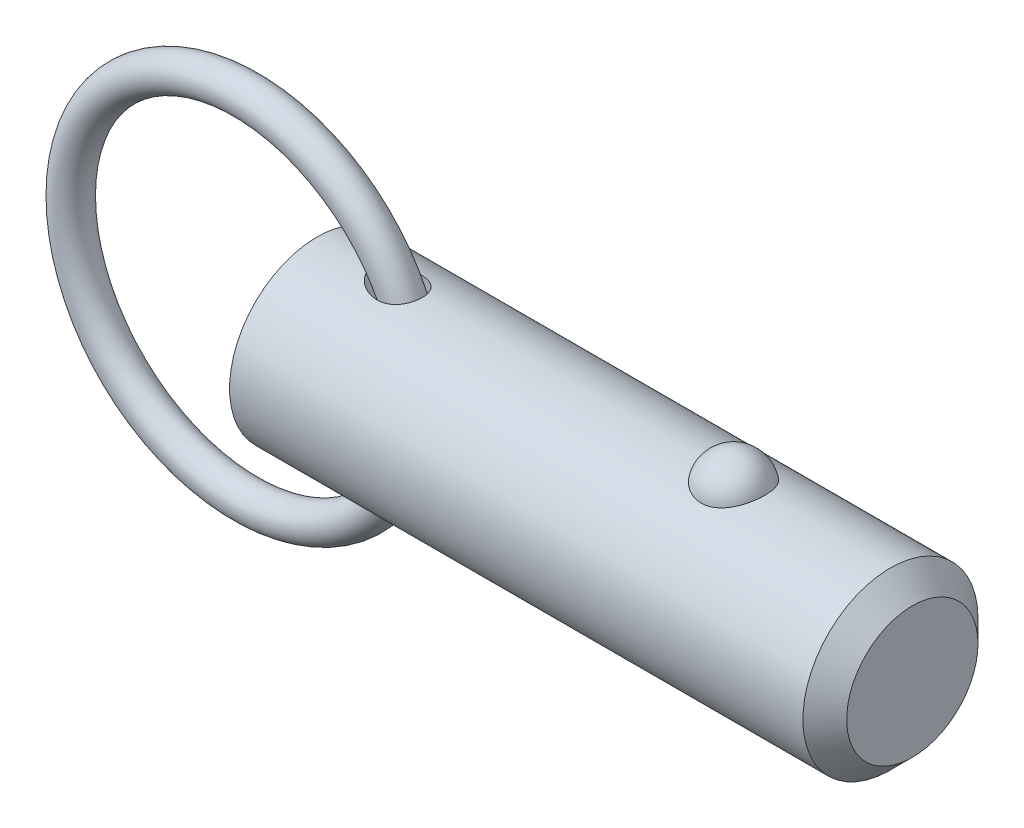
ISO-10303-21;
HEADER;
FILE_DESCRIPTION(('STEP AP214'),'2;1');
FILE_NAME('part.step','',(''),(''),'','','');
FILE_SCHEMA(('AUTOMOTIVE_DESIGN { 1 0 10303 214 1 1 1 1 }'));
ENDSEC;
DATA;
#1=APPLICATION_CONTEXT('core data for automotive mechanical design processes');
#2=APPLICATION_PROTOCOL_DEFINITION('international standard','automotive_design',2000,#1);
#3=PRODUCT_CONTEXT('',#1,'mechanical');
#4=PRODUCT('Part','Part','',(#3));
#5=PRODUCT_RELATED_PRODUCT_CATEGORY('part','',(#4));
#6=PRODUCT_DEFINITION_FORMATION('','',#4);
#7=PRODUCT_DEFINITION_CONTEXT('part definition',#1,'design');
#8=PRODUCT_DEFINITION('design','',#6,#7);
#9=PRODUCT_DEFINITION_SHAPE('','',#8);
#10=(LENGTH_UNIT() NAMED_UNIT(*) SI_UNIT(.MILLI.,.METRE.));
#11=(NAMED_UNIT(*) PLANE_ANGLE_UNIT() SI_UNIT($,.RADIAN.));
#12=(NAMED_UNIT(*) SI_UNIT($,.STERADIAN.) SOLID_ANGLE_UNIT());
#13=UNCERTAINTY_MEASURE_WITH_UNIT(LENGTH_MEASURE(1.E-05),#10,'distance_accuracy_value','');
#14=(GEOMETRIC_REPRESENTATION_CONTEXT(3) GLOBAL_UNCERTAINTY_ASSIGNED_CONTEXT((#13)) GLOBAL_UNIT_ASSIGNED_CONTEXT((#10,
#11,#12)) REPRESENTATION_CONTEXT('',''));
#15=CARTESIAN_POINT('',(0.,0.,0.));
#16=DIRECTION('',(0.,0.,1.));
#17=DIRECTION('',(1.,0.,0.));
#18=AXIS2_PLACEMENT_3D('',#15,#16,#17);
#19=CARTESIAN_POINT('',(-6.46799987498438,0.,0.));
#20=DIRECTION('',(0.,0.,1.));
#21=DIRECTION('',(1.,0.,0.));
#22=AXIS2_PLACEMENT_3D('',#19,#20,#21);
#23=TOROIDAL_SURFACE('',#22,15.875,1.588);
#24=CARTESIAN_POINT('',(10.9950001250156,0.,0.));
#25=VERTEX_POINT('',#24);
#26=VERTEX_LOOP('',#25);
#27=FACE_BOUND('',#26,.T.);
#28=ADVANCED_FACE('P0_F12',(#27),#23,.T.);
#29=CLOSED_SHELL('',(#28));
#30=MANIFOLD_SOLID_BREP('P0_B1',#29);
#31=CARTESIAN_POINT('',(0.,0.,0.));
#32=DIRECTION('',(1.,0.,0.));
#33=DIRECTION('',(0.,0.,-1.));
#34=AXIS2_PLACEMENT_3D('',#31,#32,#33);
#35=CYLINDRICAL_SURFACE('',#34,7.94);
#36=CARTESIAN_POINT('',(5.37881269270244,7.8641200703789,-1.0950869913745));
#37=CARTESIAN_POINT('',(5.49078530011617,7.84653010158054,-1.22142628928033));
#38=CARTESIAN_POINT('',(5.61742164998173,7.82766483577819,-1.33478448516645));
#39=CARTESIAN_POINT('',(5.82155225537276,7.80005811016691,-1.48501770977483));
#40=CARTESIAN_POINT('',(5.89211597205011,7.79095331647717,-1.53186949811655));
#41=CARTESIAN_POINT('',(6.03726296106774,7.77331484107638,-1.61899652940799));
#42=CARTESIAN_POINT('',(6.11184478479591,7.76478095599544,-1.65927412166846));
#43=CARTESIAN_POINT('',(6.3183154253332,7.74290334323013,-1.75933205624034));
#44=CARTESIAN_POINT('',(6.45343253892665,7.73042593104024,-1.81276183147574));
#45=CARTESIAN_POINT('',(6.73017339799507,7.70966096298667,-1.89912673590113));
#46=CARTESIAN_POINT('',(6.87179099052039,7.70136953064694,-1.93208083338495));
#47=CARTESIAN_POINT('',(7.17522096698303,7.6896684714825,-1.97820987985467));
#48=CARTESIAN_POINT('',(7.33750100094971,7.68691980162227,-1.98871513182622));
#49=CARTESIAN_POINT('',(7.5799424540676,7.68880305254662,-1.98137951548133));
#50=CARTESIAN_POINT('',(7.66059155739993,7.69043175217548,-1.97508575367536));
#51=CARTESIAN_POINT('',(7.82077465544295,7.69570110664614,-1.95445819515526));
#52=CARTESIAN_POINT('',(7.90030910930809,7.69934090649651,-1.94012781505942));
#53=CARTESIAN_POINT('',(8.092800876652,7.71066069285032,-1.89475688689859));
#54=CARTESIAN_POINT('',(8.2046520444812,7.71942251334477,-1.85909462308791));
#55=CARTESIAN_POINT('',(8.42059371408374,7.74035594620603,-1.7699066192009));
#56=CARTESIAN_POINT('',(8.52468939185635,7.75252525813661,-1.7163929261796));
#57=CARTESIAN_POINT('',(8.72211003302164,7.77903750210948,-1.59192358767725));
#58=CARTESIAN_POINT('',(8.81539818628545,7.79338749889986,-1.52091076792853));
#59=CARTESIAN_POINT('',(8.98759177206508,7.8225086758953,-1.36321590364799));
#60=CARTESIAN_POINT('',(9.06649712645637,7.83727985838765,-1.27653377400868));
#61=CARTESIAN_POINT('',(9.20311499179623,7.86453692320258,-1.09567667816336));
#62=CARTESIAN_POINT('',(9.26180839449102,7.8771064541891,-1.00225329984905));
#63=CARTESIAN_POINT('',(9.36257622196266,7.89954213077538,-0.806547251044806));
#64=CARTESIAN_POINT('',(9.40465301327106,7.9094086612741,-0.704265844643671));
#65=CARTESIAN_POINT('',(9.47062404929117,7.92520709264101,-0.495461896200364));
#66=CARTESIAN_POINT('',(9.49478817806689,7.9311972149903,-0.38902885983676));
#67=CARTESIAN_POINT('',(9.52544004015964,7.93883641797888,-0.17349446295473));
#68=CARTESIAN_POINT('',(9.53192786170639,7.94048552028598,-0.0643931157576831));
#69=CARTESIAN_POINT('',(9.52707996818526,7.93926454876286,0.153487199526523));
#70=CARTESIAN_POINT('',(9.51572796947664,7.93639034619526,0.262265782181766));
#71=CARTESIAN_POINT('',(9.47542322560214,7.92642470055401,0.47631311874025));
#72=CARTESIAN_POINT('',(9.44647056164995,7.91933327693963,0.581581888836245));
#73=CARTESIAN_POINT('',(9.37164011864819,7.90170355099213,0.785602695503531));
#74=CARTESIAN_POINT('',(9.32576415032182,7.89116561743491,0.884355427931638));
#75=CARTESIAN_POINT('',(9.21823065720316,7.8677977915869,1.07254831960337));
#76=CARTESIAN_POINT('',(9.15657431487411,7.85496807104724,1.16198917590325));
#77=CARTESIAN_POINT('',(9.01919194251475,7.82843688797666,1.32903649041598));
#78=CARTESIAN_POINT('',(8.94347744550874,7.81473614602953,1.40665255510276));
#79=CARTESIAN_POINT('',(8.78012086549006,7.7879321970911,1.5481977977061));
#80=CARTESIAN_POINT('',(8.69247914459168,7.77482897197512,1.61212739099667));
#81=CARTESIAN_POINT('',(8.5064231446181,7.75037063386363,1.72592270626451));
#82=CARTESIAN_POINT('',(8.40786430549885,7.73904540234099,1.77555777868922));
#83=CARTESIAN_POINT('',(8.20398708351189,7.71943979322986,1.85894844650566));
#84=CARTESIAN_POINT('',(8.09866701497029,7.7111601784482,1.89270006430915));
#85=CARTESIAN_POINT('',(7.87703213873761,7.69782475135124,1.94625652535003));
#86=CARTESIAN_POINT('',(7.76044899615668,7.69301557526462,1.96500324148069));
#87=CARTESIAN_POINT('',(7.5257425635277,7.68770484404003,1.98567257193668));
#88=CARTESIAN_POINT('',(7.40761868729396,7.68720497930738,1.98758858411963));
#89=CARTESIAN_POINT('',(7.15639592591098,7.69044495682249,1.97502233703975));
#90=CARTESIAN_POINT('',(7.02341871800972,7.69476380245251,1.9583009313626));
#91=CARTESIAN_POINT('',(6.76125891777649,7.70776394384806,1.90648094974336));
#92=CARTESIAN_POINT('',(6.63208047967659,7.71644984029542,1.87136299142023));
#93=CARTESIAN_POINT('',(6.35978215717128,7.73875442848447,1.77707737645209));
#94=CARTESIAN_POINT('',(6.2177212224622,7.75293863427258,1.71496895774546));
#95=CARTESIAN_POINT('',(5.94559201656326,7.78383102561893,1.56880760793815));
#96=CARTESIAN_POINT('',(5.81552062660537,7.80053855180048,1.48476040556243));
#97=CARTESIAN_POINT('',(5.60081087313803,7.83035955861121,1.31701356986));
#98=CARTESIAN_POINT('',(5.51265224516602,7.84340226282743,1.23780647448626));
#99=CARTESIAN_POINT('',(5.34976240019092,7.86852524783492,1.06647953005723));
#100=CARTESIAN_POINT('',(5.27500719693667,7.88060722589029,0.974383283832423));
#101=CARTESIAN_POINT('',(5.15877594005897,7.89990441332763,0.800548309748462));
#102=CARTESIAN_POINT('',(5.11360209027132,7.90759876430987,0.721348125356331));
#103=CARTESIAN_POINT('',(5.03655060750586,7.92090267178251,0.556518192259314));
#104=CARTESIAN_POINT('',(5.00466157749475,7.92651401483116,0.470894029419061));
#105=CARTESIAN_POINT('',(4.95653766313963,7.93503671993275,0.294356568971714));
#106=CARTESIAN_POINT('',(4.94043621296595,7.93792505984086,0.203404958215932));
#107=CARTESIAN_POINT('',(4.92605720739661,7.94050250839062,0.0200631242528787));
#108=CARTESIAN_POINT('',(4.92776929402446,7.9401934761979,-0.0723262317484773));
#109=CARTESIAN_POINT('',(4.94742735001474,7.93667454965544,-0.243250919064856));
#110=CARTESIAN_POINT('',(4.96327131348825,7.93384031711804,-0.322048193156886));
#111=CARTESIAN_POINT('',(5.00707570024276,7.92609115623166,-0.476058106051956));
#112=CARTESIAN_POINT('',(5.03503965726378,7.92117562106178,-0.55126969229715));
#113=CARTESIAN_POINT('',(5.10737112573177,7.90866290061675,-0.709995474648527));
#114=CARTESIAN_POINT('',(5.15379379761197,7.90074105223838,-0.792541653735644));
#115=CARTESIAN_POINT('',(5.25820836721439,7.88338732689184,-0.949781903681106));
#116=CARTESIAN_POINT('',(5.31621941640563,7.87395295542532,-1.02446265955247));
#117=CARTESIAN_POINT('',(5.37881269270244,7.8641200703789,-1.0950869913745));
#118=B_SPLINE_CURVE_WITH_KNOTS('',3,(#36,#37,#38,#39,#40,#41,#42,#43,#44,#45,#46,#47,#48,#49,
#50,#51,#52,#53,#54,#55,#56,#57,#58,#59,#60,#61,#62,#63,#64,#65,#66,#67,#68,#69,#70,#71,#72,#73,
#74,#75,#76,#77,#78,#79,#80,#81,#82,#83,#84,#85,#86,#87,#88,#89,#90,#91,#92,#93,#94,#95,#96,#97,
#98,#99,#100,#101,#102,#103,#104,#105,#106,#107,#108,#109,#110,#111,#112,#113,#114,#115,#116,
#117),.UNSPECIFIED.,.T.,.F.,(4,2,2,2,2,2,2,2,2,2,2,2,2,2,2,2,2,2,2,2,2,2,2,2,2,2,2,2,2,2,2,2,2,
2,2,2,2,2,2,2,4),(0.,0.508599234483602,0.763935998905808,1.01918131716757,1.45492798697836,
1.89027038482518,2.37502798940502,2.61739702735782,2.8596631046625,3.21120678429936,
3.56251370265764,3.91498401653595,4.26745624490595,4.59897839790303,4.93045331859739,
5.25682643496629,5.58319792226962,5.909867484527,6.23653553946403,6.56316865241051,
6.88977729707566,7.21611917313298,7.54245114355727,7.87378632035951,8.20520442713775,
8.55832700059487,8.91158808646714,9.31234018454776,9.71351536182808,10.1786231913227,
10.6436096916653,11.0001264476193,11.3559986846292,11.6294791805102,11.9027245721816,
12.1782599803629,12.4536351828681,12.693828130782,12.9340911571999,13.2179277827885,
13.5022374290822),.UNSPECIFIED.);
#119=CARTESIAN_POINT('',(5.37881269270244,7.8641200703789,-1.0950869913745));
#120=VERTEX_POINT('',#119);
#121=EDGE_CURVE('P1_E40',#120,#120,#118,.T.);
#122=ORIENTED_EDGE('',*,*,#121,.T.);
#123=EDGE_LOOP('',(#122));
#124=FACE_BOUND('',#123,.T.);
#125=CARTESIAN_POINT('',(51.995,0.,0.));
#126=DIRECTION('',(1.,0.,0.));
#127=DIRECTION('',(0.,0.,-1.));
#128=AXIS2_PLACEMENT_3D('',#125,#126,#127);
#129=CIRCLE('',#128,7.94);
#130=CARTESIAN_POINT('',(51.995,0.,-7.94));
#131=VERTEX_POINT('',#130);
#132=EDGE_CURVE('P1_E25',#131,#131,#129,.T.);
#133=ORIENTED_EDGE('',*,*,#132,.F.);
#134=EDGE_LOOP('',(#133));
#135=FACE_BOUND('',#134,.T.);
#136=CARTESIAN_POINT('',(0.,0.,0.));
#137=DIRECTION('',(1.,0.,0.));
#138=DIRECTION('',(0.,0.,-1.));
#139=AXIS2_PLACEMENT_3D('',#136,#137,#138);
#140=CIRCLE('',#139,7.94);
#141=CARTESIAN_POINT('',(0.,0.,-7.94));
#142=VERTEX_POINT('',#141);
#143=EDGE_CURVE('P1_E9',#142,#142,#140,.T.);
#144=ORIENTED_EDGE('',*,*,#143,.T.);
#145=EDGE_LOOP('',(#144));
#146=FACE_BOUND('',#145,.T.);
#147=CARTESIAN_POINT('',(37.7649074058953,7.37767842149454,2.93486986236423));
#148=CARTESIAN_POINT('',(37.6127496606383,7.3776732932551,2.93487505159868));
#149=CARTESIAN_POINT('',(37.4606329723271,7.38258419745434,2.92262454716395));
#150=CARTESIAN_POINT('',(37.1609284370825,7.40163229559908,2.87404196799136));
#151=CARTESIAN_POINT('',(37.0133394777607,7.41576720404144,2.83771585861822));
#152=CARTESIAN_POINT('',(36.7270187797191,7.4516157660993,2.74218769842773));
#153=CARTESIAN_POINT('',(36.5882745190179,7.47331841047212,2.68301886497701));
#154=CARTESIAN_POINT('',(36.3228822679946,7.52194082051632,2.54350967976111));
#155=CARTESIAN_POINT('',(36.1962366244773,7.5488615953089,2.46316523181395));
#156=CARTESIAN_POINT('',(35.9545349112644,7.60594671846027,2.2809037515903));
#157=CARTESIAN_POINT('',(35.8399065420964,7.63618114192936,2.17844211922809));
#158=CARTESIAN_POINT('',(35.6288787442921,7.69614046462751,1.95608495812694));
#159=CARTESIAN_POINT('',(35.5324826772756,7.72586526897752,1.83618622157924));
#160=CARTESIAN_POINT('',(35.3559381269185,7.78314821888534,1.57628086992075));
#161=CARTESIAN_POINT('',(35.2767072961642,7.81055035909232,1.43561546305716));
#162=CARTESIAN_POINT('',(35.1417979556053,7.85879631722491,1.14236334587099));
#163=CARTESIAN_POINT('',(35.0861216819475,7.87963951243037,0.98977550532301));
#164=CARTESIAN_POINT('',(34.9988121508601,7.91289645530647,0.674619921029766));
#165=CARTESIAN_POINT('',(34.9675309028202,7.925186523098,0.511941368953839));
#166=CARTESIAN_POINT('',(34.930975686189,7.93958930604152,0.183247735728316));
#167=CARTESIAN_POINT('',(34.9257012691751,7.94170219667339,0.017232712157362));
#168=CARTESIAN_POINT('',(34.9412311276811,7.93554931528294,-0.312672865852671));
#169=CARTESIAN_POINT('',(34.9619253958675,7.92732732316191,-0.4765694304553));
#170=CARTESIAN_POINT('',(35.0287865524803,7.90141534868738,-0.798305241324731));
#171=CARTESIAN_POINT('',(35.0749539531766,7.88372517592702,-0.956144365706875));
#172=CARTESIAN_POINT('',(35.1918986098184,7.84066230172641,-1.26152073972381));
#173=CARTESIAN_POINT('',(35.2627046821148,7.81528060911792,-1.40904568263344));
#174=CARTESIAN_POINT('',(35.4274789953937,7.7594867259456,-1.68950598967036));
#175=CARTESIAN_POINT('',(35.5214488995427,7.72907417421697,-1.82244030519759));
#176=CARTESIAN_POINT('',(35.7308391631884,7.66640424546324,-2.07032792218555));
#177=CARTESIAN_POINT('',(35.8463152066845,7.63414223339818,-2.1852330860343));
#178=CARTESIAN_POINT('',(36.0959006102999,7.57149681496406,-2.39329737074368));
#179=CARTESIAN_POINT('',(36.2300080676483,7.54111321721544,-2.48645870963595));
#180=CARTESIAN_POINT('',(36.5101113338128,7.48650742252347,-2.64628132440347));
#181=CARTESIAN_POINT('',(36.6557605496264,7.46215900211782,-2.71350554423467));
#182=CARTESIAN_POINT('',(36.9574259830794,7.42171253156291,-2.82226614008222));
#183=CARTESIAN_POINT('',(37.1134383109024,7.40561140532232,-2.86381209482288));
#184=CARTESIAN_POINT('',(37.4229708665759,7.3842679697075,-2.9183907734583));
#185=CARTESIAN_POINT('',(37.5762229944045,7.37852109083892,-2.93275024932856));
#186=CARTESIAN_POINT('',(37.8830705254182,7.37700973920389,-2.93655208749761));
#187=CARTESIAN_POINT('',(38.0366658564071,7.38124333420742,-2.92599927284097));
#188=CARTESIAN_POINT('',(38.3349907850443,7.39890635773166,-2.88102897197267));
#189=CARTESIAN_POINT('',(38.4798480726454,7.41205491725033,-2.8473399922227));
#190=CARTESIAN_POINT('',(38.7616432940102,7.445801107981,-2.75788206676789));
#191=CARTESIAN_POINT('',(38.8985805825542,7.46639934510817,-2.70211132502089));
#192=CARTESIAN_POINT('',(39.1640619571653,7.51339098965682,-2.56858908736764));
#193=CARTESIAN_POINT('',(39.2923548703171,7.53990200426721,-2.49038067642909));
#194=CARTESIAN_POINT('',(39.5342440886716,7.59569503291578,-2.31462737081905));
#195=CARTESIAN_POINT('',(39.6478370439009,7.6249776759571,-2.21707808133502));
#196=CARTESIAN_POINT('',(39.86322156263,7.68489473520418,-1.99982049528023));
#197=CARTESIAN_POINT('',(39.9641488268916,7.71552419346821,-1.87925337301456));
#198=CARTESIAN_POINT('',(40.1451866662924,7.77353016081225,-1.62268826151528));
#199=CARTESIAN_POINT('',(40.2252934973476,7.80090608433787,-1.4866875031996));
#200=CARTESIAN_POINT('',(40.3653615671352,7.85047992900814,-1.19818413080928));
#201=CARTESIAN_POINT('',(40.4245877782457,7.87248183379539,-1.04529016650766));
#202=CARTESIAN_POINT('',(40.5179821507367,7.90785114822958,-0.731080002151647));
#203=CARTESIAN_POINT('',(40.5521497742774,7.92121837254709,-0.569763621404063));
#204=CARTESIAN_POINT('',(40.594795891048,7.93797834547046,-0.242812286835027));
#205=CARTESIAN_POINT('',(40.6032047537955,7.94134405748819,-0.0771668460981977));
#206=CARTESIAN_POINT('',(40.5939626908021,7.93767937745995,0.253276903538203));
#207=CARTESIAN_POINT('',(40.5763120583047,7.93064910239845,0.418075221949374));
#208=CARTESIAN_POINT('',(40.5154247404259,7.90695571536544,0.741525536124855));
#209=CARTESIAN_POINT('',(40.4722819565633,7.8903279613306,0.900197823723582));
#210=CARTESIAN_POINT('',(40.3613535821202,7.84916386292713,1.20759654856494));
#211=CARTESIAN_POINT('',(40.29356656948,7.82462706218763,1.35632241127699));
#212=CARTESIAN_POINT('',(40.1343718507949,7.7700669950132,1.64032869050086));
#213=CARTESIAN_POINT('',(40.0428616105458,7.7400200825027,1.77554712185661));
#214=CARTESIAN_POINT('',(39.8382960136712,7.67774175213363,2.02800648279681));
#215=CARTESIAN_POINT('',(39.7252410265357,7.64551037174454,2.14524772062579));
#216=CARTESIAN_POINT('',(39.4808318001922,7.58265895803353,2.35778002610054));
#217=CARTESIAN_POINT('',(39.3495833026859,7.55203092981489,2.45319004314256));
#218=CARTESIAN_POINT('',(39.071601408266,7.49579792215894,2.61999897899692));
#219=CARTESIAN_POINT('',(38.9248670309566,7.47019326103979,2.69139637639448));
#220=CARTESIAN_POINT('',(38.6129477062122,7.42622216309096,2.8105324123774));
#221=CARTESIAN_POINT('',(38.4472209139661,7.40825002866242,2.85700910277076));
#222=CARTESIAN_POINT('',(38.1092792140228,7.38398348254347,2.9191685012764));
#223=CARTESIAN_POINT('',(37.9370670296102,7.3776842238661,2.93486399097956));
#224=CARTESIAN_POINT('',(37.7649074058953,7.37767842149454,2.93486986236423));
#225=B_SPLINE_CURVE_WITH_KNOTS('',3,(#147,#148,#149,#150,#151,#152,#153,#154,#155,#156,#157,
#158,#159,#160,#161,#162,#163,#164,#165,#166,#167,#168,#169,#170,#171,#172,#173,#174,#175,#176,
#177,#178,#179,#180,#181,#182,#183,#184,#185,#186,#187,#188,#189,#190,#191,#192,#193,#194,#195,
#196,#197,#198,#199,#200,#201,#202,#203,#204,#205,#206,#207,#208,#209,#210,#211,#212,#213,#214,
#215,#216,#217,#218,#219,#220,#221,#222,#223,#224),.UNSPECIFIED.,.T.,.F.,(4,2,2,2,2,2,2,2,2,2,2,
2,2,2,2,2,2,2,2,2,2,2,2,2,2,2,2,2,2,2,2,2,2,2,2,2,2,2,4),(0.,0.45584132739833,0.911569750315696,
1.36663794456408,1.82179423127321,2.28978983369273,2.7578716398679,3.246853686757,
3.73588214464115,4.23184282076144,4.72779494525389,5.22165321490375,5.71552141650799,
6.20996917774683,6.70445245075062,7.20023431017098,7.69596557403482,8.18023418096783,
8.66432203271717,9.12410697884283,9.58380291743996,10.0296503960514,10.4755341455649,
10.9312349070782,11.3870393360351,11.8654416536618,12.3439299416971,12.8378875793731,
13.3318558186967,13.8271581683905,14.3224549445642,14.8159385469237,15.3094506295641,
15.8051323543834,16.3008055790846,16.7937101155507,17.2866458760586,17.8026240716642,
18.3183879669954),.UNSPECIFIED.);
#226=CARTESIAN_POINT('',(37.7649074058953,7.37767842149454,2.93486986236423));
#227=VERTEX_POINT('',#226);
#228=EDGE_CURVE('P1_E34',#227,#227,#225,.T.);
#229=ORIENTED_EDGE('',*,*,#228,.T.);
#230=EDGE_LOOP('',(#229));
#231=FACE_BOUND('',#230,.T.);
#232=CARTESIAN_POINT('',(5.37881269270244,-7.8641200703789,-1.0950869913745));
#233=CARTESIAN_POINT('',(5.31532711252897,-7.87409326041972,-1.02345575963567));
#234=CARTESIAN_POINT('',(5.25654962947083,-7.88365715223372,-0.947641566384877));
#235=CARTESIAN_POINT('',(5.15093536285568,-7.90122221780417,-0.787865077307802));
#236=CARTESIAN_POINT('',(5.10408931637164,-7.90922460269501,-0.703909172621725));
#237=CARTESIAN_POINT('',(5.02499142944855,-7.92292057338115,-0.5279916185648));
#238=CARTESIAN_POINT('',(4.99290048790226,-7.92858863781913,-0.435954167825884));
#239=CARTESIAN_POINT('',(4.94718343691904,-7.93670712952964,-0.247266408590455));
#240=CARTESIAN_POINT('',(4.93353142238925,-7.93916207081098,-0.150622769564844));
#241=CARTESIAN_POINT('',(4.92669426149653,-7.94038957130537,0.0306459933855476));
#242=CARTESIAN_POINT('',(4.93105622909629,-7.93960347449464,0.115182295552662));
#243=CARTESIAN_POINT('',(4.95441758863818,-7.93542535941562,0.2821331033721));
#244=CARTESIAN_POINT('',(4.97342060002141,-7.93203269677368,0.364547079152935));
#245=CARTESIAN_POINT('',(5.02337664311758,-7.92322764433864,0.521528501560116));
#246=CARTESIAN_POINT('',(5.0537758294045,-7.91790920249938,0.596281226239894));
#247=CARTESIAN_POINT('',(5.12468720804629,-7.90571364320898,0.740640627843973));
#248=CARTESIAN_POINT('',(5.16520358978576,-7.89883588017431,0.810245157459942));
#249=CARTESIAN_POINT('',(5.27792634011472,-7.88012470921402,0.97862022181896));
#250=CARTESIAN_POINT('',(5.35563200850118,-7.86757912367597,1.07363778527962));
#251=CARTESIAN_POINT('',(5.52523836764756,-7.84150676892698,1.24994147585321));
#252=CARTESIAN_POINT('',(5.61717506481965,-7.82797755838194,1.33119164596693));
#253=CARTESIAN_POINT('',(5.83913717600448,-7.79742756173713,1.50104748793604));
#254=CARTESIAN_POINT('',(5.97257429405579,-7.78050347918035,1.58521567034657));
#255=CARTESIAN_POINT('',(6.25160600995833,-7.74942135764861,1.73078109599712));
#256=CARTESIAN_POINT('',(6.39720857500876,-7.73526515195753,1.79216327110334));
#257=CARTESIAN_POINT('',(6.69793322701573,-7.7116170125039,1.89134478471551));
#258=CARTESIAN_POINT('',(6.85312134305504,-7.70216275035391,1.92895428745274));
#259=CARTESIAN_POINT('',(7.16781951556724,-7.68988337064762,1.97736316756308));
#260=CARTESIAN_POINT('',(7.32732244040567,-7.68704791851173,1.98820434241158));
#261=CARTESIAN_POINT('',(7.61290770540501,-7.68890797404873,1.98097687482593));
#262=CARTESIAN_POINT('',(7.73913797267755,-7.69217875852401,1.96837928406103));
#263=CARTESIAN_POINT('',(7.98774248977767,-7.70364253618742,1.92303262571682));
#264=CARTESIAN_POINT('',(8.11011880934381,-7.71183283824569,1.89029457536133));
#265=CARTESIAN_POINT('',(8.34766306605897,-7.73253074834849,1.80375920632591));
#266=CARTESIAN_POINT('',(8.46278682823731,-7.74506226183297,1.74984505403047));
#267=CARTESIAN_POINT('',(8.68062682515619,-7.77294147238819,1.62149891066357));
#268=CARTESIAN_POINT('',(8.78334736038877,-7.78828818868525,1.54707406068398));
#269=CARTESIAN_POINT('',(8.9627595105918,-7.81808719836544,1.38814746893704));
#270=CARTESIAN_POINT('',(9.04102925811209,-7.83247448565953,1.30540890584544));
#271=CARTESIAN_POINT('',(9.18176824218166,-7.86008608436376,1.1272733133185));
#272=CARTESIAN_POINT('',(9.24424163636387,-7.87331070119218,1.03187962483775));
#273=CARTESIAN_POINT('',(9.34924815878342,-7.89649032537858,0.83568428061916));
#274=CARTESIAN_POINT('',(9.39252490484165,-7.90656172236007,0.735293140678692));
#275=CARTESIAN_POINT('',(9.46188913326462,-7.92307290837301,0.528458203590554));
#276=CARTESIAN_POINT('',(9.48797767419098,-7.92951292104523,0.422014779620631));
#277=CARTESIAN_POINT('',(9.52228670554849,-7.93804067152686,0.206589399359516));
#278=CARTESIAN_POINT('',(9.53058328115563,-7.94014694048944,0.0976202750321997));
#279=CARTESIAN_POINT('',(9.52935292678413,-7.93983698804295,-0.120212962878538));
#280=CARTESIAN_POINT('',(9.51982577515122,-7.93742071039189,-0.229077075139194));
#281=CARTESIAN_POINT('',(9.48313466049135,-7.92831916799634,-0.443751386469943));
#282=CARTESIAN_POINT('',(9.45594838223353,-7.92162850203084,-0.549557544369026));
#283=CARTESIAN_POINT('',(9.38454658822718,-7.90469917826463,-0.754954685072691));
#284=CARTESIAN_POINT('',(9.34033171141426,-7.89446065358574,-0.854545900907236));
#285=CARTESIAN_POINT('',(9.23602927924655,-7.87157146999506,-1.04456732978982));
#286=CARTESIAN_POINT('',(9.17596171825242,-7.85892385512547,-1.13500888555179));
#287=CARTESIAN_POINT('',(9.0415343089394,-7.83259746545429,-1.30436780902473));
#288=CARTESIAN_POINT('',(8.96717562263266,-7.81891877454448,-1.38328611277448));
#289=CARTESIAN_POINT('',(8.80603455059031,-7.79196869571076,-1.52782923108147));
#290=CARTESIAN_POINT('',(8.71921490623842,-7.77869867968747,-1.59341269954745));
#291=CARTESIAN_POINT('',(8.53589430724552,-7.7539823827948,-1.7096493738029));
#292=CARTESIAN_POINT('',(8.43939269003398,-7.74253622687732,-1.76030155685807));
#293=CARTESIAN_POINT('',(8.23614706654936,-7.72219212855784,-1.84754820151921));
#294=CARTESIAN_POINT('',(8.1291686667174,-7.71339202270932,-1.88361685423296));
#295=CARTESIAN_POINT('',(7.91082287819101,-7.69955300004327,-1.93940887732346));
#296=CARTESIAN_POINT('',(7.79945379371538,-7.69451555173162,-1.95912586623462));
#297=CARTESIAN_POINT('',(7.56409927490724,-7.6881073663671,-1.98413612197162));
#298=CARTESIAN_POINT('',(7.43993744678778,-7.68713944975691,-1.98784574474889));
#299=CARTESIAN_POINT('',(7.19239878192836,-7.68969629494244,-1.97792309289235));
#300=CARTESIAN_POINT('',(7.06902225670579,-7.69322274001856,-1.96428432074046));
#301=CARTESIAN_POINT('',(6.80624991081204,-7.70498367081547,-1.91768089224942));
#302=CARTESIAN_POINT('',(6.66736121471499,-7.71386737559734,-1.88203087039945));
#303=CARTESIAN_POINT('',(6.39625444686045,-7.73551250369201,-1.79098714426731));
#304=CARTESIAN_POINT('',(6.26404857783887,-7.74828074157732,-1.73555871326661));
#305=CARTESIAN_POINT('',(6.06559048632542,-7.77003865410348,-1.63446133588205));
#306=CARTESIAN_POINT('',(5.99591479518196,-7.77821880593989,-1.59522999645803));
#307=CARTESIAN_POINT('',(5.86025875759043,-7.79503524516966,-1.51091846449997));
#308=CARTESIAN_POINT('',(5.79427944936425,-7.8036716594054,-1.46583664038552));
#309=CARTESIAN_POINT('',(5.60322733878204,-7.82978128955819,-1.3219827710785));
#310=CARTESIAN_POINT('',(5.4844964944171,-7.84751780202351,-1.21433077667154));
#311=CARTESIAN_POINT('',(5.37881269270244,-7.8641200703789,-1.0950869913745));
#312=B_SPLINE_CURVE_WITH_KNOTS('',3,(#232,#233,#234,#235,#236,#237,#238,#239,#240,#241,#242,
#243,#244,#245,#246,#247,#248,#249,#250,#251,#252,#253,#254,#255,#256,#257,#258,#259,#260,#261,
#262,#263,#264,#265,#266,#267,#268,#269,#270,#271,#272,#273,#274,#275,#276,#277,#278,#279,#280,
#281,#282,#283,#284,#285,#286,#287,#288,#289,#290,#291,#292,#293,#294,#295,#296,#297,#298,#299,
#300,#301,#302,#303,#304,#305,#306,#307,#308,#309,#310,#311),.UNSPECIFIED.,.T.,.F.,(4,2,2,2,2,2,
2,2,2,2,2,2,2,2,2,2,2,2,2,2,2,2,2,2,2,2,2,2,2,2,2,2,2,2,2,2,2,2,2,4),(0.,0.288363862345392,
0.576503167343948,0.867714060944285,1.15851540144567,1.41111828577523,1.66378363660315,
1.90549406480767,2.1473047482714,2.51540453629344,2.88445136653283,3.35805159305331,
3.83196445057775,4.30961543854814,4.78652012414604,5.16565662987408,5.54458592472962,
5.92563591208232,6.30655339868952,6.64920782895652,6.99177197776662,7.31956587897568,
7.64733959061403,7.97370879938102,8.30008206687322,8.62686856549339,8.95364280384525,
9.28000684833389,9.60634436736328,9.93367879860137,10.261035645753,10.59932199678,
10.9377403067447,11.308967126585,11.6803330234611,12.1096921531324,12.5398088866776,
12.7806650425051,13.0215885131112,13.5016249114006),.UNSPECIFIED.);
#313=CARTESIAN_POINT('',(5.37881269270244,-7.8641200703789,-1.0950869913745));
#314=VERTEX_POINT('',#313);
#315=EDGE_CURVE('P1_E17',#314,#314,#312,.T.);
#316=ORIENTED_EDGE('',*,*,#315,.T.);
#317=EDGE_LOOP('',(#316));
#318=FACE_BOUND('',#317,.T.);
#319=ADVANCED_FACE('P1_F13',(#124,#135,#146,#231,#318),#35,.T.);
#320=CARTESIAN_POINT('',(0.,0.,0.));
#321=DIRECTION('',(-1.,0.,0.));
#322=DIRECTION('',(0.,0.,1.));
#323=AXIS2_PLACEMENT_3D('',#320,#321,#322);
#324=PLANE('',#323);
#325=ORIENTED_EDGE('',*,*,#143,.F.);
#326=EDGE_LOOP('',(#325));
#327=FACE_BOUND('',#326,.T.);
#328=ADVANCED_FACE('P1_F15',(#327),#324,.T.);
#329=CARTESIAN_POINT('',(53.98,0.,0.));
#330=DIRECTION('',(-1.,0.,0.));
#331=DIRECTION('',(0.,0.,1.));
#332=AXIS2_PLACEMENT_3D('',#329,#330,#331);
#333=CONICAL_SURFACE('',#332,5.95500000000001,0.785398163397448);
#334=ORIENTED_EDGE('',*,*,#132,.T.);
#335=EDGE_LOOP('',(#334));
#336=FACE_BOUND('',#335,.T.);
#337=CARTESIAN_POINT('',(53.98,0.,0.));
#338=DIRECTION('',(1.,0.,0.));
#339=DIRECTION('',(0.,0.,-1.));
#340=AXIS2_PLACEMENT_3D('',#337,#338,#339);
#341=CIRCLE('',#340,5.95500000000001);
#342=CARTESIAN_POINT('',(53.98,0.,-5.95500000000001));
#343=VERTEX_POINT('',#342);
#344=EDGE_CURVE('P1_E30',#343,#343,#341,.T.);
#345=ORIENTED_EDGE('',*,*,#344,.F.);
#346=EDGE_LOOP('',(#345));
#347=FACE_BOUND('',#346,.T.);
#348=ADVANCED_FACE('P1_F55',(#336,#347),#333,.T.);
#349=CARTESIAN_POINT('',(53.98,5.95500000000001,0.));
#350=DIRECTION('',(1.,0.,0.));
#351=DIRECTION('',(0.,0.,-1.));
#352=AXIS2_PLACEMENT_3D('',#349,#350,#351);
#353=PLANE('',#352);
#354=ORIENTED_EDGE('',*,*,#344,.T.);
#355=EDGE_LOOP('',(#354));
#356=FACE_BOUND('',#355,.T.);
#357=ADVANCED_FACE('P1_F51',(#356),#353,.T.);
#358=CARTESIAN_POINT('',(37.7649074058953,7.146,0.));
#359=DIRECTION('',(-1.,0.,0.));
#360=DIRECTION('',(0.,1.,0.));
#361=AXIS2_PLACEMENT_3D('',#358,#359,#360);
#362=SPHERICAL_SURFACE('',#361,2.944);
#363=ORIENTED_EDGE('',*,*,#228,.F.);
#364=EDGE_LOOP('',(#363));
#365=FACE_BOUND('',#364,.T.);
#366=ADVANCED_FACE('P1_F46',(#365),#362,.T.);
#367=CARTESIAN_POINT('',(-6.46799987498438,0.,0.));
#368=DIRECTION('',(0.,0.,1.));
#369=DIRECTION('',(1.,0.,0.));
#370=AXIS2_PLACEMENT_3D('',#367,#368,#369);
#371=TOROIDAL_SURFACE('',#370,15.875,1.985);
#372=ORIENTED_EDGE('',*,*,#315,.F.);
#373=EDGE_LOOP('',(#372));
#374=FACE_BOUND('',#373,.T.);
#375=ORIENTED_EDGE('',*,*,#121,.F.);
#376=EDGE_LOOP('',(#375));
#377=FACE_BOUND('',#376,.T.);
#378=ADVANCED_FACE('P1_F50',(#374,#377),#371,.F.);
#379=CLOSED_SHELL('',(#319,#328,#348,#357,#366,#378));
#380=MANIFOLD_SOLID_BREP('P1_B1',#379);
#381=ADVANCED_BREP_SHAPE_REPRESENTATION('',(#18,#30,#380),#14);
#382=SHAPE_DEFINITION_REPRESENTATION(#9,#381);
ENDSEC;
END-ISO-10303-21;
